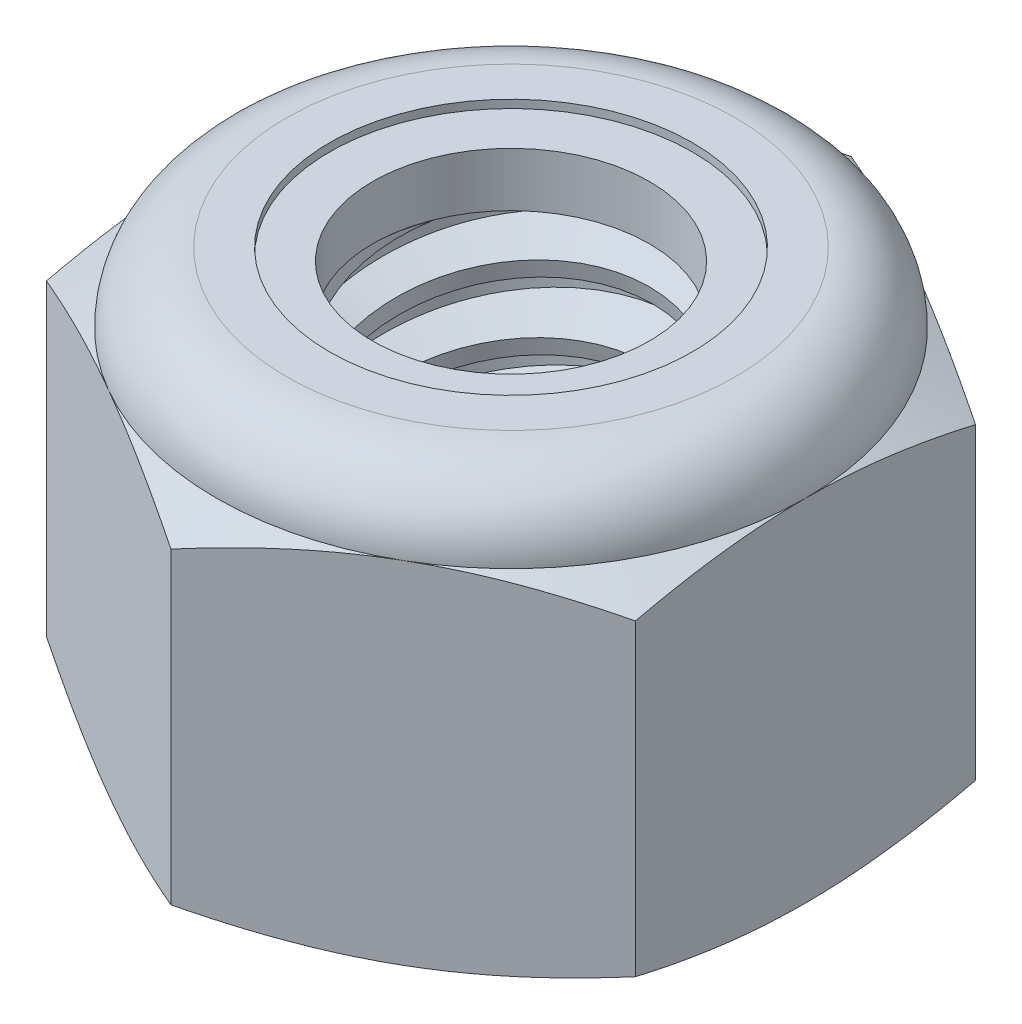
from build123d import *

# Parameters (mm, degrees)
EXTRUDE1_DEPTH      = 7.9375
SKETCH2_W           = 3.175
SKETCH2_H           = 7.9375
LPATTERN1_COUNT     = 6
LPATTERN1_PITCH     = 1.27
LPATTERN1_COL_COUNT = 2
LPATTERN1_COL_PITCH = 1.27


with BuildPart() as part:
    # Sketch1 → Extrude1 (new body)
    with BuildSketch(Plane(origin=(0, 0, 0), x_dir=(1, 0, 0), z_dir=(0, 1, 0))):
        Polygon((0, 6.415804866), (-5.55625, 3.207902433), (-5.55625, -3.207902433), (0, -6.415804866), (5.55625, -3.207902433), (5.55625, 3.207902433), align=None)
    extrude(amount=EXTRUDE1_DEPTH)

    # Sketch4 → Cut-Revolve2 (revolve, cut)
    with BuildSketch(Plane(origin=(0, 0, 0), x_dir=(0, 0, -1), z_dir=(1, 0, 0)), mode=Mode.PRIVATE) as cut_revolve2_sk:
        Polygon((0, 7.9375), (3.175, 7.9375), (2.609908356, 7.673993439), (2.609908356, 0.263506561), (3.175, 0), (0, 0), align=None)
    revolve(cut_revolve2_sk.sketch.rotate(Axis((0, 7.9375, 0), (0, 1, 0)), 54.49881281), axis=Axis((0, 7.9375, 0), (0, 1, 0)), mode=Mode.SUBTRACT)


with BuildPart() as body_2:
    # Sketch2 → Revolve1 (revolve)
    with BuildSketch(Plane(origin=(0, 0, 0), x_dir=(0, 0, -1), z_dir=(1, 0, 0))):
        with Locations((1.5875, 3.96875)):
            Rectangle(SKETCH2_W, SKETCH2_H)
    revolve(axis=Axis((0, -3.175, 0), (0, 1, 0)))

    # Sketch3 → Cut-Revolve1 (revolve, cut)
    with BuildSketch(Plane(origin=(0, 0, 0), x_dir=(0, 0, -1), z_dir=(1, 0, 0)), mode=Mode.PRIVATE) as cut_revolve1_sk:
        Polygon((3.206133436, 7.781832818), (3.424067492, 6.692162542), (2.672175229, 6.946518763), (2.609908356, 7.257853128), align=None)
    cut_revolve1 = revolve(cut_revolve1_sk.sketch.rotate(Axis((0, 7.9375, 0.272704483), (0, -0.9805806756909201, -0.19611613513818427)), 180), axis=Axis((0, 7.9375, 0.272704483), (0, -0.9805806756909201, -0.19611613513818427)), mode=Mode.SUBTRACT)

    # LPattern1: Cut-Revolve1 ×6
    with Locations(*[(0, -i * LPATTERN1_PITCH, 0) for i in range(1, LPATTERN1_COUNT)]):
        add(cut_revolve1, mode=Mode.SUBTRACT)

    # LPattern1 col: Cut-Revolve1 ×2
    with Locations(*[(0, i * LPATTERN1_COL_PITCH, 0) for i in range(1, LPATTERN1_COL_COUNT)]):
        add(cut_revolve1, mode=Mode.SUBTRACT)


with BuildPart() as part_1:
    add(part.part)

    # Combine1: cut body 2
    add(body_2.part, mode=Mode.SUBTRACT)

    # Sketch5 → Cut-Revolve3 (revolve, cut)
    with BuildSketch(Plane(origin=(0, 0, 0), x_dir=(0, 0, -1), z_dir=(1, 0, 0)), mode=Mode.PRIVATE) as cut_revolve3_sk:
        with BuildLine():
            Line((0, 0), (5.55625, 0))
            Line((5.55625, 0), (6.415804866, 0.400817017))
            Line((6.415804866, 0.400817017), (6.415804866, 6.213766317))
            Line((6.415804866, 6.213766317), (5.55625, 6.614583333))
            ThreePointArc((5.55625, 6.614583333), (5.168776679, 7.550026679), (4.233333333, 7.9375))
            Line((4.233333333, 7.9375), (4.233333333, 9.2075))
            Line((4.233333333, 9.2075), (7.685804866, 9.2075))
            Line((7.685804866, 9.2075), (7.685804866, -1.27))
            Line((7.685804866, -1.27), (0, -1.27))
            Line((0, -1.27), (0, 0))
        make_face()
    revolve(cut_revolve3_sk.sketch.rotate(Axis((0, 0, 0), (0, 1, 0)), 54.619043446), axis=Axis((0, 0, 0), (0, 1, 0)), mode=Mode.SUBTRACT)

    # Sketch6 → Cut-Revolve4 (revolve, cut)
    with BuildSketch(Plane(origin=(0, 0, 0), x_dir=(0, 0, -1), z_dir=(1, 0, 0)), mode=Mode.PRIVATE) as cut_revolve4_sk:
        with BuildLine():
            Line((0, 6.614583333), (5.40385, 6.614583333))
            ThreePointArc((5.40385, 6.614583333), (5.061013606, 7.442263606), (4.233333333, 7.7851))
            Line((4.233333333, 7.7851), (3.421620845, 7.7851))
            Line((3.421620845, 7.7851), (3.421620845, 9.2075))
            Line((3.421620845, 9.2075), (0, 9.2075))
            Line((0, 9.2075), (0, 6.614583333))
        make_face()
    revolve(cut_revolve4_sk.sketch.rotate(Axis((0, 9.2075, 0), (0, 1, 0)), 54.49881281), axis=Axis((0, 9.2075, 0), (0, 1, 0)), mode=Mode.SUBTRACT)


with BuildPart() as body_2_2:
    # Sketch7 → Revolve2 (revolve)
    with BuildSketch(Plane(origin=(0, 0, 0), x_dir=(0, 0, -1), z_dir=(1, 0, 0))):
        with BuildLine():
            Line((2.609908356, 6.690783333), (5.324993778, 6.690783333))
            ThreePointArc((5.324993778, 6.690783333), (4.979705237, 7.4148695), (4.233333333, 7.7089))
            Line((4.233333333, 7.7089), (2.609908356, 7.7089))
            Line((2.609908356, 7.7089), (2.609908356, 6.690783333))
        make_face()
    revolve(axis=Axis((0, 6.690783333, 0), (0, 1, 0)))


solid = Compound([part_1.part, body_2_2.part])
